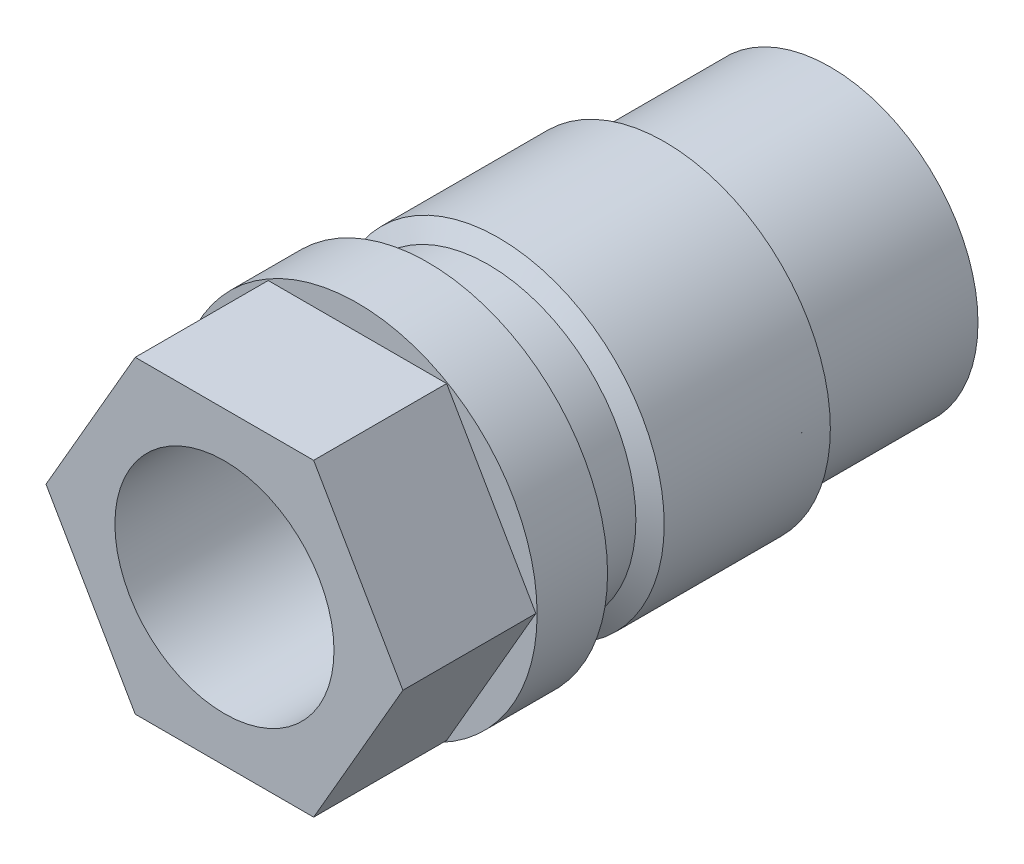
ISO-10303-21;
HEADER;
FILE_DESCRIPTION(('STEP AP214'),'2;1');
FILE_NAME('part.step','',(''),(''),'','','');
FILE_SCHEMA(('AUTOMOTIVE_DESIGN { 1 0 10303 214 1 1 1 1 }'));
ENDSEC;
DATA;
#1=APPLICATION_CONTEXT('core data for automotive mechanical design processes');
#2=APPLICATION_PROTOCOL_DEFINITION('international standard','automotive_design',2000,#1);
#3=PRODUCT_CONTEXT('',#1,'mechanical');
#4=PRODUCT('Part','Part','',(#3));
#5=PRODUCT_RELATED_PRODUCT_CATEGORY('part','',(#4));
#6=PRODUCT_DEFINITION_FORMATION('','',#4);
#7=PRODUCT_DEFINITION_CONTEXT('part definition',#1,'design');
#8=PRODUCT_DEFINITION('design','',#6,#7);
#9=PRODUCT_DEFINITION_SHAPE('','',#8);
#10=(LENGTH_UNIT() NAMED_UNIT(*) SI_UNIT(.MILLI.,.METRE.));
#11=(NAMED_UNIT(*) PLANE_ANGLE_UNIT() SI_UNIT($,.RADIAN.));
#12=(NAMED_UNIT(*) SI_UNIT($,.STERADIAN.) SOLID_ANGLE_UNIT());
#13=UNCERTAINTY_MEASURE_WITH_UNIT(LENGTH_MEASURE(1.E-05),#10,'distance_accuracy_value','');
#14=(GEOMETRIC_REPRESENTATION_CONTEXT(3) GLOBAL_UNCERTAINTY_ASSIGNED_CONTEXT((#13)) GLOBAL_UNIT_ASSIGNED_CONTEXT((#10,
#11,#12)) REPRESENTATION_CONTEXT('',''));
#15=CARTESIAN_POINT('',(0.,0.,0.));
#16=DIRECTION('',(0.,0.,1.));
#17=DIRECTION('',(1.,0.,0.));
#18=AXIS2_PLACEMENT_3D('',#15,#16,#17);
#19=CARTESIAN_POINT('',(0.,0.,14.15));
#20=DIRECTION('',(0.,0.,1.));
#21=DIRECTION('',(1.,0.,0.));
#22=AXIS2_PLACEMENT_3D('',#19,#20,#21);
#23=PLANE('',#22);
#24=CARTESIAN_POINT('',(0.,0.,14.15));
#25=DIRECTION('',(0.,0.,1.));
#26=DIRECTION('',(1.,0.,0.));
#27=AXIS2_PLACEMENT_3D('',#24,#25,#26);
#28=CIRCLE('',#27,7.62);
#29=CARTESIAN_POINT('',(7.62,0.,14.15));
#30=VERTEX_POINT('',#29);
#31=EDGE_CURVE('E148',#30,#30,#28,.T.);
#32=ORIENTED_EDGE('',*,*,#31,.F.);
#33=EDGE_LOOP('',(#32));
#34=FACE_BOUND('',#33,.T.);
#35=DIRECTION('',(0.500000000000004,0.866025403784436,0.));
#36=VECTOR('',#35,1.);
#37=CARTESIAN_POINT('',(6.20651539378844,-10.75,14.15));
#38=LINE('',#37,#36);
#39=CARTESIAN_POINT('',(6.20651539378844,-10.75,14.15));
#40=VERTEX_POINT('',#39);
#41=CARTESIAN_POINT('',(12.413030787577,0.,14.15));
#42=VERTEX_POINT('',#41);
#43=EDGE_CURVE('E108',#40,#42,#38,.T.);
#44=ORIENTED_EDGE('',*,*,#43,.T.);
#45=DIRECTION('',(-0.500000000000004,0.866025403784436,0.));
#46=VECTOR('',#45,1.);
#47=CARTESIAN_POINT('',(6.20651539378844,10.75,14.15));
#48=LINE('',#47,#46);
#49=CARTESIAN_POINT('',(6.20651539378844,10.75,14.15));
#50=VERTEX_POINT('',#49);
#51=EDGE_CURVE('E103',#42,#50,#48,.T.);
#52=ORIENTED_EDGE('',*,*,#51,.T.);
#53=DIRECTION('',(-1.,0.,0.));
#54=VECTOR('',#53,1.);
#55=CARTESIAN_POINT('',(6.20651539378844,10.75,14.15));
#56=LINE('',#55,#54);
#57=CARTESIAN_POINT('',(-6.20651539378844,10.75,14.15));
#58=VERTEX_POINT('',#57);
#59=EDGE_CURVE('E101',#50,#58,#56,.T.);
#60=ORIENTED_EDGE('',*,*,#59,.T.);
#61=DIRECTION('',(-0.500000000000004,-0.866025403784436,0.));
#62=VECTOR('',#61,1.);
#63=CARTESIAN_POINT('',(-6.20651539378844,10.75,14.15));
#64=LINE('',#63,#62);
#65=CARTESIAN_POINT('',(-12.413030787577,0.,14.15));
#66=VERTEX_POINT('',#65);
#67=EDGE_CURVE('E44',#58,#66,#64,.T.);
#68=ORIENTED_EDGE('',*,*,#67,.T.);
#69=DIRECTION('',(0.500000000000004,-0.866025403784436,0.));
#70=VECTOR('',#69,1.);
#71=CARTESIAN_POINT('',(-6.20651539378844,-10.75,14.15));
#72=LINE('',#71,#70);
#73=CARTESIAN_POINT('',(-6.20651539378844,-10.75,14.15));
#74=VERTEX_POINT('',#73);
#75=EDGE_CURVE('E90',#66,#74,#72,.T.);
#76=ORIENTED_EDGE('',*,*,#75,.T.);
#77=DIRECTION('',(1.,0.,0.));
#78=VECTOR('',#77,1.);
#79=CARTESIAN_POINT('',(6.20651539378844,-10.75,14.15));
#80=LINE('',#79,#78);
#81=EDGE_CURVE('E95',#74,#40,#80,.T.);
#82=ORIENTED_EDGE('',*,*,#81,.T.);
#83=EDGE_LOOP('',(#44,#52,#60,#68,#76,#82));
#84=FACE_BOUND('',#83,.T.);
#85=ADVANCED_FACE('F29',(#34,#84),#23,.T.);
#86=CARTESIAN_POINT('',(0.,0.,14.15));
#87=DIRECTION('',(0.,0.,-1.));
#88=DIRECTION('',(-1.,0.,0.));
#89=AXIS2_PLACEMENT_3D('',#86,#87,#88);
#90=CYLINDRICAL_SURFACE('',#89,12.5);
#91=CARTESIAN_POINT('',(0.,0.,0.));
#92=DIRECTION('',(0.,0.,1.));
#93=DIRECTION('',(1.,0.,0.));
#94=AXIS2_PLACEMENT_3D('',#91,#92,#93);
#95=CIRCLE('',#94,12.5);
#96=CARTESIAN_POINT('',(12.5,0.,0.));
#97=VERTEX_POINT('',#96);
#98=EDGE_CURVE('E151',#97,#97,#95,.T.);
#99=ORIENTED_EDGE('',*,*,#98,.T.);
#100=EDGE_LOOP('',(#99));
#101=FACE_BOUND('',#100,.T.);
#102=CARTESIAN_POINT('',(0.,0.,4.9));
#103=DIRECTION('',(0.,0.,1.));
#104=DIRECTION('',(1.,0.,0.));
#105=AXIS2_PLACEMENT_3D('',#102,#103,#104);
#106=CIRCLE('',#105,12.5);
#107=CARTESIAN_POINT('',(12.5,0.,4.9));
#108=VERTEX_POINT('',#107);
#109=EDGE_CURVE('E128',#108,#108,#106,.T.);
#110=ORIENTED_EDGE('',*,*,#109,.F.);
#111=EDGE_LOOP('',(#110));
#112=FACE_BOUND('',#111,.T.);
#113=ADVANCED_FACE('F31',(#101,#112),#90,.T.);
#114=CARTESIAN_POINT('',(0.,0.,-28.));
#115=DIRECTION('',(0.,0.,1.));
#116=DIRECTION('',(1.,0.,0.));
#117=AXIS2_PLACEMENT_3D('',#114,#115,#116);
#118=CYLINDRICAL_SURFACE('',#117,10.27);
#119=CARTESIAN_POINT('',(0.,0.,0.));
#120=DIRECTION('',(0.,0.,1.));
#121=DIRECTION('',(1.,0.,0.));
#122=AXIS2_PLACEMENT_3D('',#119,#120,#121);
#123=CIRCLE('',#122,10.27);
#124=CARTESIAN_POINT('',(10.27,0.,0.));
#125=VERTEX_POINT('',#124);
#126=EDGE_CURVE('E154',#125,#125,#123,.F.);
#127=ORIENTED_EDGE('',*,*,#126,.T.);
#128=EDGE_LOOP('',(#127));
#129=FACE_BOUND('',#128,.T.);
#130=CARTESIAN_POINT('',(0.,0.,-4.2));
#131=DIRECTION('',(0.,0.,-1.));
#132=DIRECTION('',(-1.,0.,0.));
#133=AXIS2_PLACEMENT_3D('',#130,#131,#132);
#134=CIRCLE('',#133,10.27);
#135=CARTESIAN_POINT('',(-10.27,0.,-4.2));
#136=VERTEX_POINT('',#135);
#137=EDGE_CURVE('E11',#136,#136,#134,.T.);
#138=ORIENTED_EDGE('',*,*,#137,.F.);
#139=EDGE_LOOP('',(#138));
#140=FACE_BOUND('',#139,.T.);
#141=ADVANCED_FACE('F165',(#129,#140),#118,.T.);
#142=CARTESIAN_POINT('',(0.,0.,-28.));
#143=DIRECTION('',(0.,0.,-1.));
#144=DIRECTION('',(-1.,0.,0.));
#145=AXIS2_PLACEMENT_3D('',#142,#143,#144);
#146=CIRCLE('',#145,10.27);
#147=CARTESIAN_POINT('',(-10.27,0.,-28.));
#148=VERTEX_POINT('',#147);
#149=EDGE_CURVE('E145',#148,#148,#146,.T.);
#150=ORIENTED_EDGE('',*,*,#149,.F.);
#151=EDGE_LOOP('',(#150));
#152=FACE_BOUND('',#151,.T.);
#153=CARTESIAN_POINT('',(0.,0.,-17.2));
#154=DIRECTION('',(0.,0.,1.));
#155=DIRECTION('',(1.,0.,0.));
#156=AXIS2_PLACEMENT_3D('',#153,#154,#155);
#157=CIRCLE('',#156,10.27);
#158=CARTESIAN_POINT('',(10.27,0.,-17.2));
#159=VERTEX_POINT('',#158);
#160=EDGE_CURVE('E37',#159,#159,#157,.T.);
#161=ORIENTED_EDGE('',*,*,#160,.F.);
#162=EDGE_LOOP('',(#161));
#163=FACE_BOUND('',#162,.T.);
#164=ADVANCED_FACE('F162',(#152,#163),#118,.T.);
#165=CARTESIAN_POINT('',(0.,0.,0.));
#166=DIRECTION('',(0.,0.,1.));
#167=DIRECTION('',(1.,0.,0.));
#168=AXIS2_PLACEMENT_3D('',#165,#166,#167);
#169=PLANE('',#168);
#170=ORIENTED_EDGE('',*,*,#98,.F.);
#171=EDGE_LOOP('',(#170));
#172=FACE_BOUND('',#171,.T.);
#173=ORIENTED_EDGE('',*,*,#126,.F.);
#174=EDGE_LOOP('',(#173));
#175=FACE_BOUND('',#174,.T.);
#176=ADVANCED_FACE('F164',(#172,#175),#169,.F.);
#177=CARTESIAN_POINT('',(0.,0.,14.15));
#178=DIRECTION('',(0.,0.,-1.));
#179=DIRECTION('',(-1.,0.,0.));
#180=AXIS2_PLACEMENT_3D('',#177,#178,#179);
#181=CYLINDRICAL_SURFACE('',#180,7.62);
#182=ORIENTED_EDGE('',*,*,#31,.T.);
#183=EDGE_LOOP('',(#182));
#184=FACE_BOUND('',#183,.T.);
#185=CARTESIAN_POINT('',(0.,0.,-28.));
#186=DIRECTION('',(0.,0.,-1.));
#187=DIRECTION('',(-1.,0.,0.));
#188=AXIS2_PLACEMENT_3D('',#185,#186,#187);
#189=CIRCLE('',#188,7.62);
#190=CARTESIAN_POINT('',(-7.62,0.,-28.));
#191=VERTEX_POINT('',#190);
#192=EDGE_CURVE('E142',#191,#191,#189,.T.);
#193=ORIENTED_EDGE('',*,*,#192,.T.);
#194=EDGE_LOOP('',(#193));
#195=FACE_BOUND('',#194,.T.);
#196=ADVANCED_FACE('F172',(#184,#195),#181,.F.);
#197=CARTESIAN_POINT('',(0.,0.,-28.));
#198=DIRECTION('',(0.,0.,-1.));
#199=DIRECTION('',(-1.,0.,0.));
#200=AXIS2_PLACEMENT_3D('',#197,#198,#199);
#201=PLANE('',#200);
#202=ORIENTED_EDGE('',*,*,#149,.T.);
#203=EDGE_LOOP('',(#202));
#204=FACE_BOUND('',#203,.T.);
#205=ORIENTED_EDGE('',*,*,#192,.F.);
#206=EDGE_LOOP('',(#205));
#207=FACE_BOUND('',#206,.T.);
#208=ADVANCED_FACE('F187',(#204,#207),#201,.T.);
#209=CARTESIAN_POINT('',(0.,0.,-4.2));
#210=DIRECTION('',(0.,0.,-1.));
#211=DIRECTION('',(-1.,0.,0.));
#212=AXIS2_PLACEMENT_3D('',#209,#210,#211);
#213=CONICAL_SURFACE('',#212,10.27,1.04719755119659);
#214=CARTESIAN_POINT('',(0.,0.,-4.92168783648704));
#215=DIRECTION('',(0.,0.,-1.));
#216=DIRECTION('',(-1.,0.,0.));
#217=AXIS2_PLACEMENT_3D('',#214,#215,#216);
#218=CIRCLE('',#217,11.52);
#219=CARTESIAN_POINT('',(-11.52,0.,-4.92168783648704));
#220=VERTEX_POINT('',#219);
#221=EDGE_CURVE('E136',#220,#220,#218,.T.);
#222=ORIENTED_EDGE('',*,*,#221,.F.);
#223=EDGE_LOOP('',(#222));
#224=FACE_BOUND('',#223,.T.);
#225=ORIENTED_EDGE('',*,*,#137,.T.);
#226=EDGE_LOOP('',(#225));
#227=FACE_BOUND('',#226,.T.);
#228=ADVANCED_FACE('F192',(#224,#227),#213,.T.);
#229=CARTESIAN_POINT('',(0.,0.,-16.478312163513));
#230=DIRECTION('',(0.,0.,1.));
#231=DIRECTION('',(1.,0.,0.));
#232=AXIS2_PLACEMENT_3D('',#229,#230,#231);
#233=CONICAL_SURFACE('',#232,11.52,1.04719755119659);
#234=ORIENTED_EDGE('',*,*,#160,.T.);
#235=EDGE_LOOP('',(#234));
#236=FACE_BOUND('',#235,.T.);
#237=CARTESIAN_POINT('',(0.,0.,-16.478312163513));
#238=DIRECTION('',(0.,0.,-1.));
#239=DIRECTION('',(-1.,0.,0.));
#240=AXIS2_PLACEMENT_3D('',#237,#238,#239);
#241=CIRCLE('',#240,11.52);
#242=CARTESIAN_POINT('',(-11.52,0.,-16.478312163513));
#243=VERTEX_POINT('',#242);
#244=EDGE_CURVE('E139',#243,#243,#241,.T.);
#245=ORIENTED_EDGE('',*,*,#244,.T.);
#246=EDGE_LOOP('',(#245));
#247=FACE_BOUND('',#246,.T.);
#248=ADVANCED_FACE('F159',(#236,#247),#233,.T.);
#249=CARTESIAN_POINT('',(0.,0.,-46.));
#250=DIRECTION('',(0.,0.,-1.));
#251=DIRECTION('',(-1.,0.,0.));
#252=AXIS2_PLACEMENT_3D('',#249,#250,#251);
#253=CYLINDRICAL_SURFACE('',#252,11.52);
#254=ORIENTED_EDGE('',*,*,#244,.F.);
#255=EDGE_LOOP('',(#254));
#256=FACE_BOUND('',#255,.T.);
#257=ORIENTED_EDGE('',*,*,#221,.T.);
#258=EDGE_LOOP('',(#257));
#259=FACE_BOUND('',#258,.T.);
#260=ADVANCED_FACE('F205',(#256,#259),#253,.T.);
#261=CARTESIAN_POINT('',(0.,0.,4.9));
#262=DIRECTION('',(0.,0.,1.));
#263=DIRECTION('',(1.,0.,0.));
#264=AXIS2_PLACEMENT_3D('',#261,#262,#263);
#265=PLANE('',#264);
#266=DIRECTION('',(0.500000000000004,0.866025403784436,0.));
#267=VECTOR('',#266,1.);
#268=CARTESIAN_POINT('',(6.20651539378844,-10.75,4.9));
#269=LINE('',#268,#267);
#270=CARTESIAN_POINT('',(6.20651539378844,-10.75,4.9));
#271=VERTEX_POINT('',#270);
#272=CARTESIAN_POINT('',(12.413030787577,0.,4.9));
#273=VERTEX_POINT('',#272);
#274=EDGE_CURVE('E122',#271,#273,#269,.T.);
#275=ORIENTED_EDGE('',*,*,#274,.F.);
#276=DIRECTION('',(1.,0.,0.));
#277=VECTOR('',#276,1.);
#278=CARTESIAN_POINT('',(6.20651539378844,-10.75,4.9));
#279=LINE('',#278,#277);
#280=CARTESIAN_POINT('',(-6.20651539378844,-10.75,4.9));
#281=VERTEX_POINT('',#280);
#282=EDGE_CURVE('E119',#281,#271,#279,.T.);
#283=ORIENTED_EDGE('',*,*,#282,.F.);
#284=DIRECTION('',(0.500000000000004,-0.866025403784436,0.));
#285=VECTOR('',#284,1.);
#286=CARTESIAN_POINT('',(-6.20651539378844,-10.75,4.9));
#287=LINE('',#286,#285);
#288=CARTESIAN_POINT('',(-12.413030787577,0.,4.9));
#289=VERTEX_POINT('',#288);
#290=EDGE_CURVE('E117',#289,#281,#287,.T.);
#291=ORIENTED_EDGE('',*,*,#290,.F.);
#292=DIRECTION('',(-0.500000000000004,-0.866025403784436,0.));
#293=VECTOR('',#292,1.);
#294=CARTESIAN_POINT('',(-6.20651539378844,10.75,4.9));
#295=LINE('',#294,#293);
#296=CARTESIAN_POINT('',(-6.20651539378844,10.75,4.9));
#297=VERTEX_POINT('',#296);
#298=EDGE_CURVE('E52',#297,#289,#295,.T.);
#299=ORIENTED_EDGE('',*,*,#298,.F.);
#300=DIRECTION('',(-1.,0.,0.));
#301=VECTOR('',#300,1.);
#302=CARTESIAN_POINT('',(6.20651539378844,10.75,4.9));
#303=LINE('',#302,#301);
#304=CARTESIAN_POINT('',(6.20651539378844,10.75,4.9));
#305=VERTEX_POINT('',#304);
#306=EDGE_CURVE('E113',#305,#297,#303,.T.);
#307=ORIENTED_EDGE('',*,*,#306,.F.);
#308=DIRECTION('',(-0.500000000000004,0.866025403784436,0.));
#309=VECTOR('',#308,1.);
#310=CARTESIAN_POINT('',(6.20651539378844,10.75,4.9));
#311=LINE('',#310,#309);
#312=EDGE_CURVE('E110',#273,#305,#311,.T.);
#313=ORIENTED_EDGE('',*,*,#312,.F.);
#314=EDGE_LOOP('',(#275,#283,#291,#299,#307,#313));
#315=FACE_BOUND('',#314,.T.);
#316=ORIENTED_EDGE('',*,*,#109,.T.);
#317=EDGE_LOOP('',(#316));
#318=FACE_BOUND('',#317,.T.);
#319=ADVANCED_FACE('F208',(#315,#318),#265,.T.);
#320=CARTESIAN_POINT('',(6.20651539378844,10.75,4.9));
#321=DIRECTION('',(0.866025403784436,0.500000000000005,0.));
#322=DIRECTION('',(-0.500000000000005,0.866025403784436,0.));
#323=AXIS2_PLACEMENT_3D('',#320,#321,#322);
#324=PLANE('',#323);
#325=ORIENTED_EDGE('',*,*,#51,.F.);
#326=DIRECTION('',(0.,0.,1.));
#327=VECTOR('',#326,1.);
#328=CARTESIAN_POINT('',(12.413030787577,0.,4.9));
#329=LINE('',#328,#327);
#330=EDGE_CURVE('E126',#273,#42,#329,.T.);
#331=ORIENTED_EDGE('',*,*,#330,.F.);
#332=ORIENTED_EDGE('',*,*,#312,.T.);
#333=DIRECTION('',(0.,0.,1.));
#334=VECTOR('',#333,1.);
#335=CARTESIAN_POINT('',(6.20651539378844,10.75,4.9));
#336=LINE('',#335,#334);
#337=EDGE_CURVE('E125',#305,#50,#336,.T.);
#338=ORIENTED_EDGE('',*,*,#337,.T.);
#339=EDGE_LOOP('',(#325,#331,#332,#338));
#340=FACE_BOUND('',#339,.T.);
#341=ADVANCED_FACE('F212',(#340),#324,.T.);
#342=CARTESIAN_POINT('',(6.20651539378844,-10.75,4.9));
#343=DIRECTION('',(0.866025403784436,-0.500000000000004,0.));
#344=DIRECTION('',(0.500000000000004,0.866025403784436,0.));
#345=AXIS2_PLACEMENT_3D('',#342,#343,#344);
#346=PLANE('',#345);
#347=ORIENTED_EDGE('',*,*,#43,.F.);
#348=DIRECTION('',(0.,0.,1.));
#349=VECTOR('',#348,1.);
#350=CARTESIAN_POINT('',(6.20651539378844,-10.75,4.9));
#351=LINE('',#350,#349);
#352=EDGE_CURVE('E129',#271,#40,#351,.T.);
#353=ORIENTED_EDGE('',*,*,#352,.F.);
#354=ORIENTED_EDGE('',*,*,#274,.T.);
#355=ORIENTED_EDGE('',*,*,#330,.T.);
#356=EDGE_LOOP('',(#347,#353,#354,#355));
#357=FACE_BOUND('',#356,.T.);
#358=ADVANCED_FACE('F215',(#357),#346,.T.);
#359=CARTESIAN_POINT('',(6.20651539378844,-10.75,4.9));
#360=DIRECTION('',(0.,-1.,0.));
#361=DIRECTION('',(0.,0.,-1.));
#362=AXIS2_PLACEMENT_3D('',#359,#360,#361);
#363=PLANE('',#362);
#364=ORIENTED_EDGE('',*,*,#81,.F.);
#365=DIRECTION('',(0.,0.,1.));
#366=VECTOR('',#365,1.);
#367=CARTESIAN_POINT('',(-6.20651539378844,-10.75,4.9));
#368=LINE('',#367,#366);
#369=EDGE_CURVE('E86',#281,#74,#368,.T.);
#370=ORIENTED_EDGE('',*,*,#369,.F.);
#371=ORIENTED_EDGE('',*,*,#282,.T.);
#372=ORIENTED_EDGE('',*,*,#352,.T.);
#373=EDGE_LOOP('',(#364,#370,#371,#372));
#374=FACE_BOUND('',#373,.T.);
#375=ADVANCED_FACE('F225',(#374),#363,.T.);
#376=CARTESIAN_POINT('',(-6.20651539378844,-10.75,4.9));
#377=DIRECTION('',(-0.866025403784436,-0.500000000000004,0.));
#378=DIRECTION('',(0.500000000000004,-0.866025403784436,0.));
#379=AXIS2_PLACEMENT_3D('',#376,#377,#378);
#380=PLANE('',#379);
#381=ORIENTED_EDGE('',*,*,#75,.F.);
#382=DIRECTION('',(0.,0.,1.));
#383=VECTOR('',#382,1.);
#384=CARTESIAN_POINT('',(-12.413030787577,0.,4.9));
#385=LINE('',#384,#383);
#386=EDGE_CURVE('E81',#289,#66,#385,.T.);
#387=ORIENTED_EDGE('',*,*,#386,.F.);
#388=ORIENTED_EDGE('',*,*,#290,.T.);
#389=ORIENTED_EDGE('',*,*,#369,.T.);
#390=EDGE_LOOP('',(#381,#387,#388,#389));
#391=FACE_BOUND('',#390,.T.);
#392=ADVANCED_FACE('F91',(#391),#380,.T.);
#393=CARTESIAN_POINT('',(-6.20651539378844,10.75,4.9));
#394=DIRECTION('',(-0.866025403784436,0.500000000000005,0.));
#395=DIRECTION('',(-0.500000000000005,-0.866025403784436,0.));
#396=AXIS2_PLACEMENT_3D('',#393,#394,#395);
#397=PLANE('',#396);
#398=ORIENTED_EDGE('',*,*,#67,.F.);
#399=DIRECTION('',(0.,0.,1.));
#400=VECTOR('',#399,1.);
#401=CARTESIAN_POINT('',(-6.20651539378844,10.75,4.9));
#402=LINE('',#401,#400);
#403=EDGE_CURVE('E87',#297,#58,#402,.T.);
#404=ORIENTED_EDGE('',*,*,#403,.F.);
#405=ORIENTED_EDGE('',*,*,#298,.T.);
#406=ORIENTED_EDGE('',*,*,#386,.T.);
#407=EDGE_LOOP('',(#398,#404,#405,#406));
#408=FACE_BOUND('',#407,.T.);
#409=ADVANCED_FACE('F83',(#408),#397,.T.);
#410=CARTESIAN_POINT('',(6.20651539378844,10.75,4.9));
#411=DIRECTION('',(0.,1.,0.));
#412=DIRECTION('',(0.,0.,1.));
#413=AXIS2_PLACEMENT_3D('',#410,#411,#412);
#414=PLANE('',#413);
#415=ORIENTED_EDGE('',*,*,#59,.F.);
#416=ORIENTED_EDGE('',*,*,#337,.F.);
#417=ORIENTED_EDGE('',*,*,#306,.T.);
#418=ORIENTED_EDGE('',*,*,#403,.T.);
#419=EDGE_LOOP('',(#415,#416,#417,#418));
#420=FACE_BOUND('',#419,.T.);
#421=ADVANCED_FACE('F217',(#420),#414,.T.);
#422=CLOSED_SHELL('',(#85,#113,#141,#164,#176,#196,#208,#228,#248,#260,#319,#341,#358,#375,#392,
#409,#421));
#423=MANIFOLD_SOLID_BREP('B2',#422);
#424=ADVANCED_BREP_SHAPE_REPRESENTATION('',(#18,#423),#14);
#425=SHAPE_DEFINITION_REPRESENTATION(#9,#424);
ENDSEC;
END-ISO-10303-21;
